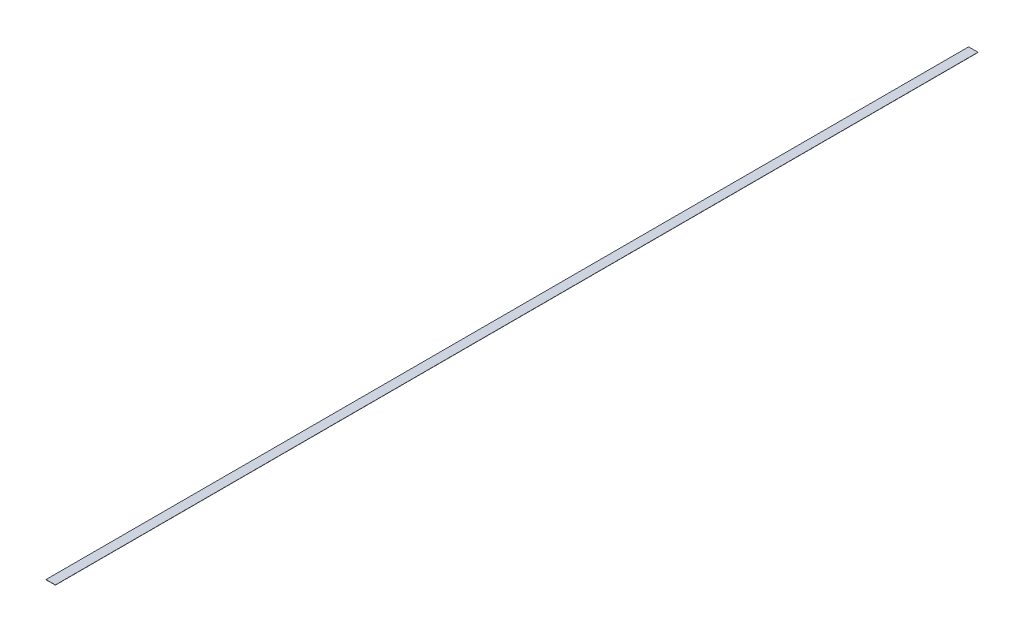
ISO-10303-21;
HEADER;
FILE_DESCRIPTION(('STEP AP214'),'2;1');
FILE_NAME('part.step','',(''),(''),'','','');
FILE_SCHEMA(('AUTOMOTIVE_DESIGN { 1 0 10303 214 1 1 1 1 }'));
ENDSEC;
DATA;
#1=APPLICATION_CONTEXT('core data for automotive mechanical design processes');
#2=APPLICATION_PROTOCOL_DEFINITION('international standard','automotive_design',2000,#1);
#3=PRODUCT_CONTEXT('',#1,'mechanical');
#4=PRODUCT('Part','Part','',(#3));
#5=PRODUCT_RELATED_PRODUCT_CATEGORY('part','',(#4));
#6=PRODUCT_DEFINITION_FORMATION('','',#4);
#7=PRODUCT_DEFINITION_CONTEXT('part definition',#1,'design');
#8=PRODUCT_DEFINITION('design','',#6,#7);
#9=PRODUCT_DEFINITION_SHAPE('','',#8);
#10=(LENGTH_UNIT() NAMED_UNIT(*) SI_UNIT(.MILLI.,.METRE.));
#11=(NAMED_UNIT(*) PLANE_ANGLE_UNIT() SI_UNIT($,.RADIAN.));
#12=(NAMED_UNIT(*) SI_UNIT($,.STERADIAN.) SOLID_ANGLE_UNIT());
#13=UNCERTAINTY_MEASURE_WITH_UNIT(LENGTH_MEASURE(1.E-05),#10,'distance_accuracy_value','');
#14=(GEOMETRIC_REPRESENTATION_CONTEXT(3) GLOBAL_UNCERTAINTY_ASSIGNED_CONTEXT((#13)) GLOBAL_UNIT_ASSIGNED_CONTEXT((#10,
#11,#12)) REPRESENTATION_CONTEXT('',''));
#15=CARTESIAN_POINT('',(0.,0.,0.));
#16=DIRECTION('',(0.,0.,1.));
#17=DIRECTION('',(1.,0.,0.));
#18=AXIS2_PLACEMENT_3D('',#15,#16,#17);
#19=CARTESIAN_POINT('',(-76.2000000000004,3.175,-7499.302792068));
#20=DIRECTION('',(1.,0.,0.));
#21=DIRECTION('',(0.,0.,-1.));
#22=AXIS2_PLACEMENT_3D('',#19,#20,#21);
#23=PLANE('',#22);
#24=DIRECTION('',(0.,0.,1.));
#25=VECTOR('',#24,1.);
#26=CARTESIAN_POINT('',(-76.2000000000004,0.,-7499.302792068));
#27=LINE('',#26,#25);
#28=CARTESIAN_POINT('',(-76.2000000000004,0.,-7499.302792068));
#29=VERTEX_POINT('',#28);
#30=CARTESIAN_POINT('',(-76.1999999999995,0.,7499.302792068));
#31=VERTEX_POINT('',#30);
#32=EDGE_CURVE('E96',#29,#31,#27,.T.);
#33=ORIENTED_EDGE('',*,*,#32,.T.);
#34=DIRECTION('',(0.,-1.,0.));
#35=VECTOR('',#34,1.);
#36=CARTESIAN_POINT('',(-76.1999999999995,3.175,7499.302792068));
#37=LINE('',#36,#35);
#38=CARTESIAN_POINT('',(-76.1999999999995,3.175,7499.302792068));
#39=VERTEX_POINT('',#38);
#40=EDGE_CURVE('E11',#39,#31,#37,.T.);
#41=ORIENTED_EDGE('',*,*,#40,.F.);
#42=DIRECTION('',(0.,0.,1.));
#43=VECTOR('',#42,1.);
#44=CARTESIAN_POINT('',(-76.2000000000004,3.175,-7499.302792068));
#45=LINE('',#44,#43);
#46=CARTESIAN_POINT('',(-76.2000000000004,3.175,-7499.302792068));
#47=VERTEX_POINT('',#46);
#48=EDGE_CURVE('E84',#47,#39,#45,.T.);
#49=ORIENTED_EDGE('',*,*,#48,.F.);
#50=DIRECTION('',(0.,-1.,0.));
#51=VECTOR('',#50,1.);
#52=CARTESIAN_POINT('',(-76.2000000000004,3.175,-7499.302792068));
#53=LINE('',#52,#51);
#54=EDGE_CURVE('E92',#47,#29,#53,.T.);
#55=ORIENTED_EDGE('',*,*,#54,.T.);
#56=EDGE_LOOP('',(#33,#41,#49,#55));
#57=FACE_BOUND('',#56,.T.);
#58=ADVANCED_FACE('F33',(#57),#23,.F.);
#59=CARTESIAN_POINT('',(-76.1999999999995,3.175,7499.302792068));
#60=DIRECTION('',(0.,0.,-1.));
#61=DIRECTION('',(-1.,0.,0.));
#62=AXIS2_PLACEMENT_3D('',#59,#60,#61);
#63=PLANE('',#62);
#64=DIRECTION('',(1.,0.,0.));
#65=VECTOR('',#64,1.);
#66=CARTESIAN_POINT('',(-76.1999999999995,0.,7499.302792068));
#67=LINE('',#66,#65);
#68=CARTESIAN_POINT('',(76.1999999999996,0.,7499.302792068));
#69=VERTEX_POINT('',#68);
#70=EDGE_CURVE('E88',#31,#69,#67,.T.);
#71=ORIENTED_EDGE('',*,*,#70,.T.);
#72=DIRECTION('',(0.,-1.,0.));
#73=VECTOR('',#72,1.);
#74=CARTESIAN_POINT('',(76.1999999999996,3.175,7499.302792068));
#75=LINE('',#74,#73);
#76=CARTESIAN_POINT('',(76.1999999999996,3.175,7499.302792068));
#77=VERTEX_POINT('',#76);
#78=EDGE_CURVE('E41',#77,#69,#75,.T.);
#79=ORIENTED_EDGE('',*,*,#78,.F.);
#80=DIRECTION('',(1.,0.,0.));
#81=VECTOR('',#80,1.);
#82=CARTESIAN_POINT('',(-76.1999999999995,3.175,7499.302792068));
#83=LINE('',#82,#81);
#84=EDGE_CURVE('E79',#39,#77,#83,.T.);
#85=ORIENTED_EDGE('',*,*,#84,.F.);
#86=ORIENTED_EDGE('',*,*,#40,.T.);
#87=EDGE_LOOP('',(#71,#79,#85,#86));
#88=FACE_BOUND('',#87,.T.);
#89=ADVANCED_FACE('F87',(#88),#63,.F.);
#90=CARTESIAN_POINT('',(76.1999999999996,3.175,-7499.302792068));
#91=DIRECTION('',(-1.,0.,0.));
#92=DIRECTION('',(0.,0.,1.));
#93=AXIS2_PLACEMENT_3D('',#90,#91,#92);
#94=PLANE('',#93);
#95=DIRECTION('',(0.,0.,-1.));
#96=VECTOR('',#95,1.);
#97=CARTESIAN_POINT('',(76.1999999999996,0.,-7499.302792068));
#98=LINE('',#97,#96);
#99=CARTESIAN_POINT('',(76.1999999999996,0.,-7499.302792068));
#100=VERTEX_POINT('',#99);
#101=EDGE_CURVE('E66',#69,#100,#98,.T.);
#102=ORIENTED_EDGE('',*,*,#101,.T.);
#103=DIRECTION('',(0.,-1.,0.));
#104=VECTOR('',#103,1.);
#105=CARTESIAN_POINT('',(76.1999999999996,3.175,-7499.302792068));
#106=LINE('',#105,#104);
#107=CARTESIAN_POINT('',(76.1999999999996,3.175,-7499.302792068));
#108=VERTEX_POINT('',#107);
#109=EDGE_CURVE('E89',#108,#100,#106,.T.);
#110=ORIENTED_EDGE('',*,*,#109,.F.);
#111=DIRECTION('',(0.,0.,-1.));
#112=VECTOR('',#111,1.);
#113=CARTESIAN_POINT('',(76.1999999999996,3.175,-7499.302792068));
#114=LINE('',#113,#112);
#115=EDGE_CURVE('E82',#77,#108,#114,.T.);
#116=ORIENTED_EDGE('',*,*,#115,.F.);
#117=ORIENTED_EDGE('',*,*,#78,.T.);
#118=EDGE_LOOP('',(#102,#110,#116,#117));
#119=FACE_BOUND('',#118,.T.);
#120=ADVANCED_FACE('F90',(#119),#94,.F.);
#121=CARTESIAN_POINT('',(-76.2000000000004,3.175,-7499.302792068));
#122=DIRECTION('',(0.,0.,1.));
#123=DIRECTION('',(1.,0.,0.));
#124=AXIS2_PLACEMENT_3D('',#121,#122,#123);
#125=PLANE('',#124);
#126=DIRECTION('',(-1.,0.,0.));
#127=VECTOR('',#126,1.);
#128=CARTESIAN_POINT('',(-76.2000000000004,0.,-7499.302792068));
#129=LINE('',#128,#127);
#130=EDGE_CURVE('E72',#100,#29,#129,.T.);
#131=ORIENTED_EDGE('',*,*,#130,.T.);
#132=ORIENTED_EDGE('',*,*,#54,.F.);
#133=DIRECTION('',(-1.,0.,0.));
#134=VECTOR('',#133,1.);
#135=CARTESIAN_POINT('',(-76.2000000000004,3.175,-7499.302792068));
#136=LINE('',#135,#134);
#137=EDGE_CURVE('E49',#108,#47,#136,.T.);
#138=ORIENTED_EDGE('',*,*,#137,.F.);
#139=ORIENTED_EDGE('',*,*,#109,.T.);
#140=EDGE_LOOP('',(#131,#132,#138,#139));
#141=FACE_BOUND('',#140,.T.);
#142=ADVANCED_FACE('F103',(#141),#125,.F.);
#143=CARTESIAN_POINT('',(0.,3.175,0.));
#144=DIRECTION('',(0.,1.,0.));
#145=DIRECTION('',(0.,0.,1.));
#146=AXIS2_PLACEMENT_3D('',#143,#144,#145);
#147=PLANE('',#146);
#148=ORIENTED_EDGE('',*,*,#48,.T.);
#149=ORIENTED_EDGE('',*,*,#84,.T.);
#150=ORIENTED_EDGE('',*,*,#115,.T.);
#151=ORIENTED_EDGE('',*,*,#137,.T.);
#152=EDGE_LOOP('',(#148,#149,#150,#151));
#153=FACE_BOUND('',#152,.T.);
#154=ADVANCED_FACE('F80',(#153),#147,.T.);
#155=CARTESIAN_POINT('',(0.,0.,0.));
#156=DIRECTION('',(0.,1.,0.));
#157=DIRECTION('',(0.,0.,1.));
#158=AXIS2_PLACEMENT_3D('',#155,#156,#157);
#159=PLANE('',#158);
#160=ORIENTED_EDGE('',*,*,#32,.F.);
#161=ORIENTED_EDGE('',*,*,#130,.F.);
#162=ORIENTED_EDGE('',*,*,#101,.F.);
#163=ORIENTED_EDGE('',*,*,#70,.F.);
#164=EDGE_LOOP('',(#160,#161,#162,#163));
#165=FACE_BOUND('',#164,.T.);
#166=ADVANCED_FACE('F106',(#165),#159,.F.);
#167=CLOSED_SHELL('',(#58,#89,#120,#142,#154,#166));
#168=MANIFOLD_SOLID_BREP('B2',#167);
#169=ADVANCED_BREP_SHAPE_REPRESENTATION('',(#18,#168),#14);
#170=SHAPE_DEFINITION_REPRESENTATION(#9,#169);
ENDSEC;
END-ISO-10303-21;
